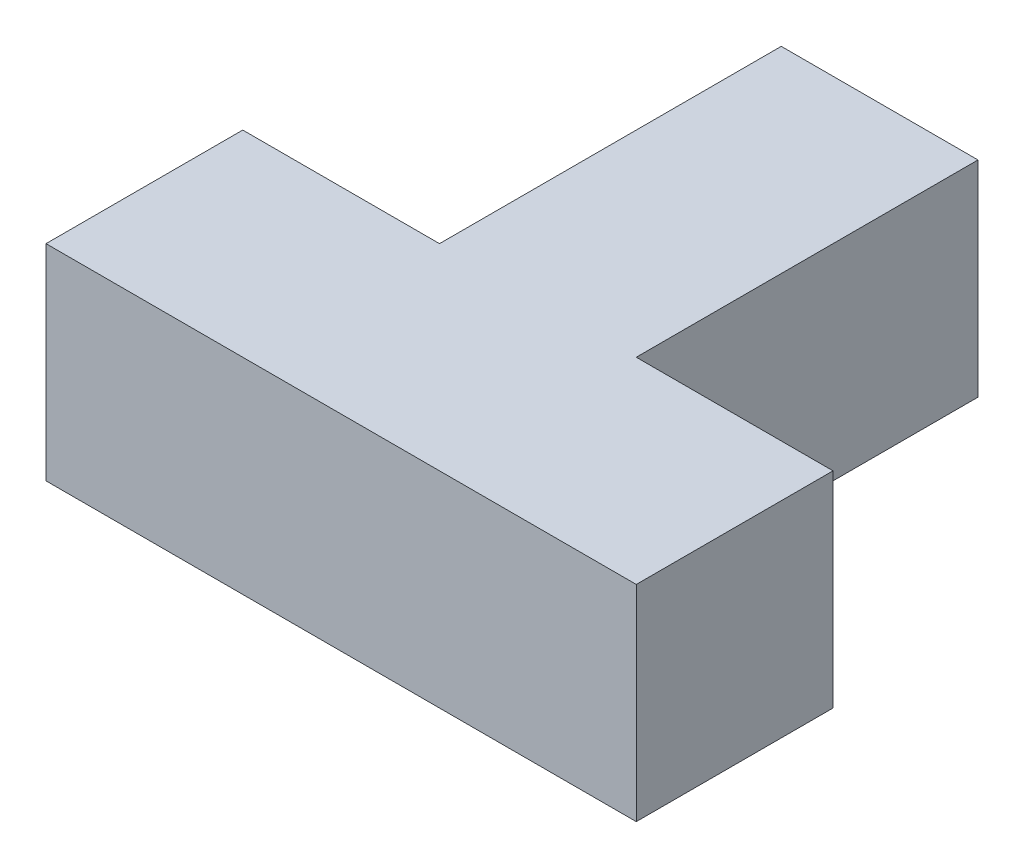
ISO-10303-21;
HEADER;
FILE_DESCRIPTION(('STEP AP214'),'2;1');
FILE_NAME('part.step','',(''),(''),'','','');
FILE_SCHEMA(('AUTOMOTIVE_DESIGN { 1 0 10303 214 1 1 1 1 }'));
ENDSEC;
DATA;
#1=APPLICATION_CONTEXT('core data for automotive mechanical design processes');
#2=APPLICATION_PROTOCOL_DEFINITION('international standard','automotive_design',2000,#1);
#3=PRODUCT_CONTEXT('',#1,'mechanical');
#4=PRODUCT('Part','Part','',(#3));
#5=PRODUCT_RELATED_PRODUCT_CATEGORY('part','',(#4));
#6=PRODUCT_DEFINITION_FORMATION('','',#4);
#7=PRODUCT_DEFINITION_CONTEXT('part definition',#1,'design');
#8=PRODUCT_DEFINITION('design','',#6,#7);
#9=PRODUCT_DEFINITION_SHAPE('','',#8);
#10=(LENGTH_UNIT() NAMED_UNIT(*) SI_UNIT(.MILLI.,.METRE.));
#11=(NAMED_UNIT(*) PLANE_ANGLE_UNIT() SI_UNIT($,.RADIAN.));
#12=(NAMED_UNIT(*) SI_UNIT($,.STERADIAN.) SOLID_ANGLE_UNIT());
#13=UNCERTAINTY_MEASURE_WITH_UNIT(LENGTH_MEASURE(1.E-05),#10,'distance_accuracy_value','');
#14=(GEOMETRIC_REPRESENTATION_CONTEXT(3) GLOBAL_UNCERTAINTY_ASSIGNED_CONTEXT((#13)) GLOBAL_UNIT_ASSIGNED_CONTEXT((#10,
#11,#12)) REPRESENTATION_CONTEXT('',''));
#15=CARTESIAN_POINT('',(0.,0.,0.));
#16=DIRECTION('',(0.,0.,1.));
#17=DIRECTION('',(1.,0.,0.));
#18=AXIS2_PLACEMENT_3D('',#15,#16,#17);
#19=CARTESIAN_POINT('',(0.,25.,-23.9422178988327));
#20=DIRECTION('',(1.,0.,0.));
#21=DIRECTION('',(0.,0.,-1.));
#22=AXIS2_PLACEMENT_3D('',#19,#20,#21);
#23=PLANE('',#22);
#24=DIRECTION('',(0.,0.,1.));
#25=VECTOR('',#24,1.);
#26=CARTESIAN_POINT('',(0.,0.,-23.9422178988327));
#27=LINE('',#26,#25);
#28=CARTESIAN_POINT('',(0.,0.,-23.9422178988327));
#29=VERTEX_POINT('',#28);
#30=CARTESIAN_POINT('',(0.,0.,0.));
#31=VERTEX_POINT('',#30);
#32=EDGE_CURVE('E128',#29,#31,#27,.T.);
#33=ORIENTED_EDGE('',*,*,#32,.T.);
#34=DIRECTION('',(0.,-1.,0.));
#35=VECTOR('',#34,1.);
#36=CARTESIAN_POINT('',(0.,25.,0.));
#37=LINE('',#36,#35);
#38=CARTESIAN_POINT('',(0.,25.,0.));
#39=VERTEX_POINT('',#38);
#40=EDGE_CURVE('E11',#39,#31,#37,.T.);
#41=ORIENTED_EDGE('',*,*,#40,.F.);
#42=DIRECTION('',(0.,0.,1.));
#43=VECTOR('',#42,1.);
#44=CARTESIAN_POINT('',(0.,25.,-23.9422178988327));
#45=LINE('',#44,#43);
#46=CARTESIAN_POINT('',(0.,25.,-23.9422178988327));
#47=VERTEX_POINT('',#46);
#48=EDGE_CURVE('E142',#47,#39,#45,.T.);
#49=ORIENTED_EDGE('',*,*,#48,.F.);
#50=DIRECTION('',(0.,-1.,0.));
#51=VECTOR('',#50,1.);
#52=CARTESIAN_POINT('',(0.,25.,-23.9422178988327));
#53=LINE('',#52,#51);
#54=EDGE_CURVE('E124',#47,#29,#53,.T.);
#55=ORIENTED_EDGE('',*,*,#54,.T.);
#56=EDGE_LOOP('',(#33,#41,#49,#55));
#57=FACE_BOUND('',#56,.T.);
#58=ADVANCED_FACE('F32',(#57),#23,.F.);
#59=CARTESIAN_POINT('',(0.,25.,0.));
#60=DIRECTION('',(0.,0.,-1.));
#61=DIRECTION('',(-1.,0.,0.));
#62=AXIS2_PLACEMENT_3D('',#59,#60,#61);
#63=PLANE('',#62);
#64=DIRECTION('',(1.,0.,0.));
#65=VECTOR('',#64,1.);
#66=CARTESIAN_POINT('',(0.,0.,0.));
#67=LINE('',#66,#65);
#68=CARTESIAN_POINT('',(71.826653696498,0.,0.));
#69=VERTEX_POINT('',#68);
#70=EDGE_CURVE('E131',#31,#69,#67,.T.);
#71=ORIENTED_EDGE('',*,*,#70,.T.);
#72=DIRECTION('',(0.,-1.,0.));
#73=VECTOR('',#72,1.);
#74=CARTESIAN_POINT('',(71.826653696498,25.,0.));
#75=LINE('',#74,#73);
#76=CARTESIAN_POINT('',(71.826653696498,25.,0.));
#77=VERTEX_POINT('',#76);
#78=EDGE_CURVE('E40',#77,#69,#75,.T.);
#79=ORIENTED_EDGE('',*,*,#78,.F.);
#80=DIRECTION('',(1.,0.,0.));
#81=VECTOR('',#80,1.);
#82=CARTESIAN_POINT('',(0.,25.,0.));
#83=LINE('',#82,#81);
#84=EDGE_CURVE('E91',#39,#77,#83,.T.);
#85=ORIENTED_EDGE('',*,*,#84,.F.);
#86=ORIENTED_EDGE('',*,*,#40,.T.);
#87=EDGE_LOOP('',(#71,#79,#85,#86));
#88=FACE_BOUND('',#87,.T.);
#89=ADVANCED_FACE('F177',(#88),#63,.F.);
#90=CARTESIAN_POINT('',(71.826653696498,25.,0.));
#91=DIRECTION('',(-1.,0.,0.));
#92=DIRECTION('',(0.,0.,1.));
#93=AXIS2_PLACEMENT_3D('',#90,#91,#92);
#94=PLANE('',#93);
#95=DIRECTION('',(0.,0.,-1.));
#96=VECTOR('',#95,1.);
#97=CARTESIAN_POINT('',(71.826653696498,0.,0.));
#98=LINE('',#97,#96);
#99=CARTESIAN_POINT('',(71.826653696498,0.,-23.9422178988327));
#100=VERTEX_POINT('',#99);
#101=EDGE_CURVE('E133',#69,#100,#98,.T.);
#102=ORIENTED_EDGE('',*,*,#101,.T.);
#103=DIRECTION('',(0.,-1.,0.));
#104=VECTOR('',#103,1.);
#105=CARTESIAN_POINT('',(71.826653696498,25.,-23.9422178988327));
#106=LINE('',#105,#104);
#107=CARTESIAN_POINT('',(71.826653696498,25.,-23.9422178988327));
#108=VERTEX_POINT('',#107);
#109=EDGE_CURVE('E149',#108,#100,#106,.T.);
#110=ORIENTED_EDGE('',*,*,#109,.F.);
#111=DIRECTION('',(0.,0.,-1.));
#112=VECTOR('',#111,1.);
#113=CARTESIAN_POINT('',(71.826653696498,25.,0.));
#114=LINE('',#113,#112);
#115=EDGE_CURVE('E157',#77,#108,#114,.T.);
#116=ORIENTED_EDGE('',*,*,#115,.F.);
#117=ORIENTED_EDGE('',*,*,#78,.T.);
#118=EDGE_LOOP('',(#102,#110,#116,#117));
#119=FACE_BOUND('',#118,.T.);
#120=ADVANCED_FACE('F155',(#119),#94,.F.);
#121=CARTESIAN_POINT('',(71.826653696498,25.,-23.9422178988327));
#122=DIRECTION('',(0.,0.,1.));
#123=DIRECTION('',(1.,0.,0.));
#124=AXIS2_PLACEMENT_3D('',#121,#122,#123);
#125=PLANE('',#124);
#126=DIRECTION('',(-1.,0.,0.));
#127=VECTOR('',#126,1.);
#128=CARTESIAN_POINT('',(71.826653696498,0.,-23.9422178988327));
#129=LINE('',#128,#127);
#130=CARTESIAN_POINT('',(47.8844357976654,0.,-23.9422178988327));
#131=VERTEX_POINT('',#130);
#132=EDGE_CURVE('E135',#100,#131,#129,.T.);
#133=ORIENTED_EDGE('',*,*,#132,.T.);
#134=DIRECTION('',(0.,-1.,0.));
#135=VECTOR('',#134,1.);
#136=CARTESIAN_POINT('',(47.8844357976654,25.,-23.9422178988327));
#137=LINE('',#136,#135);
#138=CARTESIAN_POINT('',(47.8844357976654,25.,-23.9422178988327));
#139=VERTEX_POINT('',#138);
#140=EDGE_CURVE('E146',#139,#131,#137,.T.);
#141=ORIENTED_EDGE('',*,*,#140,.F.);
#142=DIRECTION('',(-1.,0.,0.));
#143=VECTOR('',#142,1.);
#144=CARTESIAN_POINT('',(71.826653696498,25.,-23.9422178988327));
#145=LINE('',#144,#143);
#146=EDGE_CURVE('E169',#108,#139,#145,.T.);
#147=ORIENTED_EDGE('',*,*,#146,.F.);
#148=ORIENTED_EDGE('',*,*,#109,.T.);
#149=EDGE_LOOP('',(#133,#141,#147,#148));
#150=FACE_BOUND('',#149,.T.);
#151=ADVANCED_FACE('F165',(#150),#125,.F.);
#152=CARTESIAN_POINT('',(47.8844357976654,25.,-23.9422178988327));
#153=DIRECTION('',(-1.,0.,0.));
#154=DIRECTION('',(0.,0.,1.));
#155=AXIS2_PLACEMENT_3D('',#152,#153,#154);
#156=PLANE('',#155);
#157=DIRECTION('',(0.,0.,-1.));
#158=VECTOR('',#157,1.);
#159=CARTESIAN_POINT('',(47.8844357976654,0.,-23.9422178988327));
#160=LINE('',#159,#158);
#161=CARTESIAN_POINT('',(47.8844357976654,0.,-65.5260700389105));
#162=VERTEX_POINT('',#161);
#163=EDGE_CURVE('E137',#131,#162,#160,.T.);
#164=ORIENTED_EDGE('',*,*,#163,.T.);
#165=DIRECTION('',(0.,-1.,0.));
#166=VECTOR('',#165,1.);
#167=CARTESIAN_POINT('',(47.8844357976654,25.,-65.5260700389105));
#168=LINE('',#167,#166);
#169=CARTESIAN_POINT('',(47.8844357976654,25.,-65.5260700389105));
#170=VERTEX_POINT('',#169);
#171=EDGE_CURVE('E119',#170,#162,#168,.T.);
#172=ORIENTED_EDGE('',*,*,#171,.F.);
#173=DIRECTION('',(0.,0.,-1.));
#174=VECTOR('',#173,1.);
#175=CARTESIAN_POINT('',(47.8844357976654,25.,-23.9422178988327));
#176=LINE('',#175,#174);
#177=EDGE_CURVE('E110',#139,#170,#176,.T.);
#178=ORIENTED_EDGE('',*,*,#177,.F.);
#179=ORIENTED_EDGE('',*,*,#140,.T.);
#180=EDGE_LOOP('',(#164,#172,#178,#179));
#181=FACE_BOUND('',#180,.T.);
#182=ADVANCED_FACE('F168',(#181),#156,.F.);
#183=CARTESIAN_POINT('',(47.8844357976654,25.,-65.5260700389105));
#184=DIRECTION('',(0.,0.,1.));
#185=DIRECTION('',(1.,0.,0.));
#186=AXIS2_PLACEMENT_3D('',#183,#184,#185);
#187=PLANE('',#186);
#188=DIRECTION('',(-1.,0.,0.));
#189=VECTOR('',#188,1.);
#190=CARTESIAN_POINT('',(47.8844357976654,0.,-65.5260700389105));
#191=LINE('',#190,#189);
#192=CARTESIAN_POINT('',(23.9422178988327,0.,-65.5260700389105));
#193=VERTEX_POINT('',#192);
#194=EDGE_CURVE('E118',#162,#193,#191,.T.);
#195=ORIENTED_EDGE('',*,*,#194,.T.);
#196=DIRECTION('',(0.,-1.,0.));
#197=VECTOR('',#196,1.);
#198=CARTESIAN_POINT('',(23.9422178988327,25.,-65.5260700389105));
#199=LINE('',#198,#197);
#200=CARTESIAN_POINT('',(23.9422178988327,25.,-65.5260700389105));
#201=VERTEX_POINT('',#200);
#202=EDGE_CURVE('E115',#201,#193,#199,.T.);
#203=ORIENTED_EDGE('',*,*,#202,.F.);
#204=DIRECTION('',(-1.,0.,0.));
#205=VECTOR('',#204,1.);
#206=CARTESIAN_POINT('',(47.8844357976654,25.,-65.5260700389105));
#207=LINE('',#206,#205);
#208=EDGE_CURVE('E104',#170,#201,#207,.T.);
#209=ORIENTED_EDGE('',*,*,#208,.F.);
#210=ORIENTED_EDGE('',*,*,#171,.T.);
#211=EDGE_LOOP('',(#195,#203,#209,#210));
#212=FACE_BOUND('',#211,.T.);
#213=ADVANCED_FACE('F116',(#212),#187,.F.);
#214=CARTESIAN_POINT('',(23.9422178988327,25.,-65.5260700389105));
#215=DIRECTION('',(1.,0.,0.));
#216=DIRECTION('',(0.,0.,-1.));
#217=AXIS2_PLACEMENT_3D('',#214,#215,#216);
#218=PLANE('',#217);
#219=DIRECTION('',(0.,0.,1.));
#220=VECTOR('',#219,1.);
#221=CARTESIAN_POINT('',(23.9422178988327,0.,-65.5260700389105));
#222=LINE('',#221,#220);
#223=CARTESIAN_POINT('',(23.9422178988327,0.,-23.9422178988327));
#224=VERTEX_POINT('',#223);
#225=EDGE_CURVE('E77',#193,#224,#222,.T.);
#226=ORIENTED_EDGE('',*,*,#225,.T.);
#227=DIRECTION('',(0.,-1.,0.));
#228=VECTOR('',#227,1.);
#229=CARTESIAN_POINT('',(23.9422178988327,25.,-23.9422178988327));
#230=LINE('',#229,#228);
#231=CARTESIAN_POINT('',(23.9422178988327,25.,-23.9422178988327));
#232=VERTEX_POINT('',#231);
#233=EDGE_CURVE('E120',#232,#224,#230,.T.);
#234=ORIENTED_EDGE('',*,*,#233,.F.);
#235=DIRECTION('',(0.,0.,1.));
#236=VECTOR('',#235,1.);
#237=CARTESIAN_POINT('',(23.9422178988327,25.,-65.5260700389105));
#238=LINE('',#237,#236);
#239=EDGE_CURVE('E108',#201,#232,#238,.T.);
#240=ORIENTED_EDGE('',*,*,#239,.F.);
#241=ORIENTED_EDGE('',*,*,#202,.T.);
#242=EDGE_LOOP('',(#226,#234,#240,#241));
#243=FACE_BOUND('',#242,.T.);
#244=ADVANCED_FACE('F122',(#243),#218,.F.);
#245=CARTESIAN_POINT('',(23.9422178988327,25.,-23.9422178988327));
#246=DIRECTION('',(0.,0.,1.));
#247=DIRECTION('',(1.,0.,0.));
#248=AXIS2_PLACEMENT_3D('',#245,#246,#247);
#249=PLANE('',#248);
#250=DIRECTION('',(-1.,0.,0.));
#251=VECTOR('',#250,1.);
#252=CARTESIAN_POINT('',(23.9422178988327,0.,-23.9422178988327));
#253=LINE('',#252,#251);
#254=EDGE_CURVE('E83',#224,#29,#253,.T.);
#255=ORIENTED_EDGE('',*,*,#254,.T.);
#256=ORIENTED_EDGE('',*,*,#54,.F.);
#257=DIRECTION('',(-1.,0.,0.));
#258=VECTOR('',#257,1.);
#259=CARTESIAN_POINT('',(23.9422178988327,25.,-23.9422178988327));
#260=LINE('',#259,#258);
#261=EDGE_CURVE('E48',#232,#47,#260,.T.);
#262=ORIENTED_EDGE('',*,*,#261,.F.);
#263=ORIENTED_EDGE('',*,*,#233,.T.);
#264=EDGE_LOOP('',(#255,#256,#262,#263));
#265=FACE_BOUND('',#264,.T.);
#266=ADVANCED_FACE('F193',(#265),#249,.F.);
#267=CARTESIAN_POINT('',(0.,25.,-23.9422178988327));
#268=DIRECTION('',(0.,-1.,0.));
#269=DIRECTION('',(0.,0.,-1.));
#270=AXIS2_PLACEMENT_3D('',#267,#268,#269);
#271=PLANE('',#270);
#272=ORIENTED_EDGE('',*,*,#48,.T.);
#273=ORIENTED_EDGE('',*,*,#84,.T.);
#274=ORIENTED_EDGE('',*,*,#115,.T.);
#275=ORIENTED_EDGE('',*,*,#146,.T.);
#276=ORIENTED_EDGE('',*,*,#177,.T.);
#277=ORIENTED_EDGE('',*,*,#208,.T.);
#278=ORIENTED_EDGE('',*,*,#239,.T.);
#279=ORIENTED_EDGE('',*,*,#261,.T.);
#280=EDGE_LOOP('',(#272,#273,#274,#275,#276,#277,#278,#279));
#281=FACE_BOUND('',#280,.T.);
#282=ADVANCED_FACE('F106',(#281),#271,.F.);
#283=CARTESIAN_POINT('',(0.,0.,-23.9422178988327));
#284=DIRECTION('',(0.,-1.,0.));
#285=DIRECTION('',(0.,0.,-1.));
#286=AXIS2_PLACEMENT_3D('',#283,#284,#285);
#287=PLANE('',#286);
#288=ORIENTED_EDGE('',*,*,#32,.F.);
#289=ORIENTED_EDGE('',*,*,#254,.F.);
#290=ORIENTED_EDGE('',*,*,#225,.F.);
#291=ORIENTED_EDGE('',*,*,#194,.F.);
#292=ORIENTED_EDGE('',*,*,#163,.F.);
#293=ORIENTED_EDGE('',*,*,#132,.F.);
#294=ORIENTED_EDGE('',*,*,#101,.F.);
#295=ORIENTED_EDGE('',*,*,#70,.F.);
#296=EDGE_LOOP('',(#288,#289,#290,#291,#292,#293,#294,#295));
#297=FACE_BOUND('',#296,.T.);
#298=ADVANCED_FACE('F161',(#297),#287,.T.);
#299=CLOSED_SHELL('',(#58,#89,#120,#151,#182,#213,#244,#266,#282,#298));
#300=MANIFOLD_SOLID_BREP('B2',#299);
#301=ADVANCED_BREP_SHAPE_REPRESENTATION('',(#18,#300),#14);
#302=SHAPE_DEFINITION_REPRESENTATION(#9,#301);
ENDSEC;
END-ISO-10303-21;
